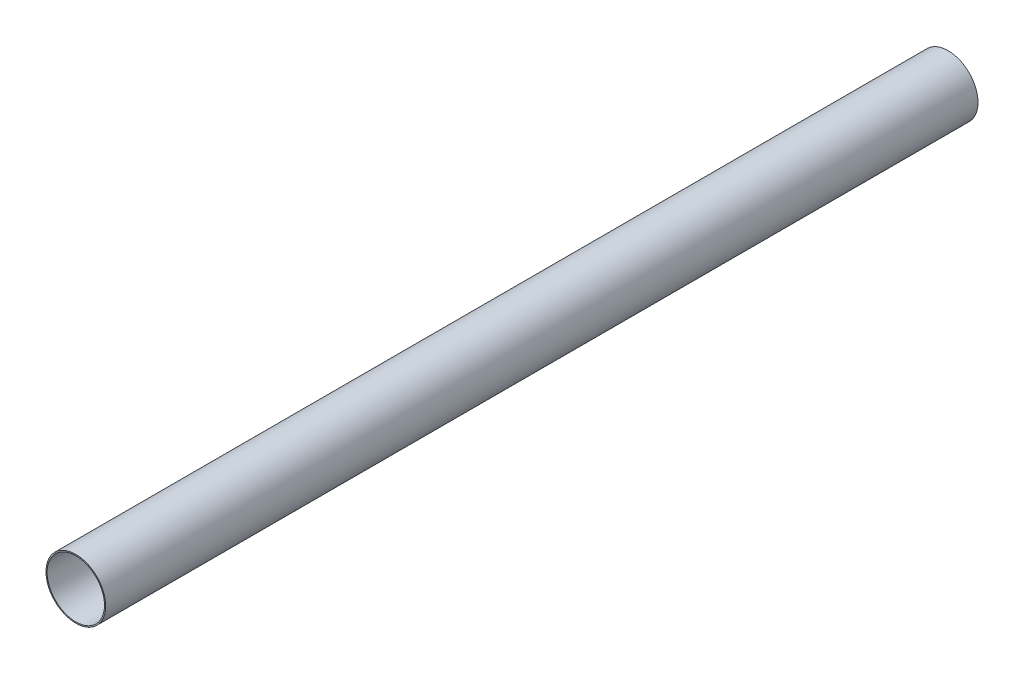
ISO-10303-21;
HEADER;
FILE_DESCRIPTION(('STEP AP214'),'2;1');
FILE_NAME('part.step','',(''),(''),'','','');
FILE_SCHEMA(('AUTOMOTIVE_DESIGN { 1 0 10303 214 1 1 1 1 }'));
ENDSEC;
DATA;
#1=APPLICATION_CONTEXT('core data for automotive mechanical design processes');
#2=APPLICATION_PROTOCOL_DEFINITION('international standard','automotive_design',2000,#1);
#3=PRODUCT_CONTEXT('',#1,'mechanical');
#4=PRODUCT('Part','Part','',(#3));
#5=PRODUCT_RELATED_PRODUCT_CATEGORY('part','',(#4));
#6=PRODUCT_DEFINITION_FORMATION('','',#4);
#7=PRODUCT_DEFINITION_CONTEXT('part definition',#1,'design');
#8=PRODUCT_DEFINITION('design','',#6,#7);
#9=PRODUCT_DEFINITION_SHAPE('','',#8);
#10=(LENGTH_UNIT() NAMED_UNIT(*) SI_UNIT(.MILLI.,.METRE.));
#11=(NAMED_UNIT(*) PLANE_ANGLE_UNIT() SI_UNIT($,.RADIAN.));
#12=(NAMED_UNIT(*) SI_UNIT($,.STERADIAN.) SOLID_ANGLE_UNIT());
#13=UNCERTAINTY_MEASURE_WITH_UNIT(LENGTH_MEASURE(1.E-05),#10,'distance_accuracy_value','');
#14=(GEOMETRIC_REPRESENTATION_CONTEXT(3) GLOBAL_UNCERTAINTY_ASSIGNED_CONTEXT((#13)) GLOBAL_UNIT_ASSIGNED_CONTEXT((#10,
#11,#12)) REPRESENTATION_CONTEXT('',''));
#15=CARTESIAN_POINT('',(0.,0.,0.));
#16=DIRECTION('',(0.,0.,1.));
#17=DIRECTION('',(1.,0.,0.));
#18=AXIS2_PLACEMENT_3D('',#15,#16,#17);
#19=CARTESIAN_POINT('',(0.,0.,380.));
#20=DIRECTION('',(0.,0.,1.));
#21=DIRECTION('',(1.,0.,0.));
#22=AXIS2_PLACEMENT_3D('',#19,#20,#21);
#23=PLANE('',#22);
#24=CARTESIAN_POINT('',(0.,0.,380.));
#25=DIRECTION('',(0.,0.,1.));
#26=DIRECTION('',(1.,0.,0.));
#27=AXIS2_PLACEMENT_3D('',#24,#25,#26);
#28=CIRCLE('',#27,26.);
#29=CARTESIAN_POINT('',(26.,0.,380.));
#30=VERTEX_POINT('',#29);
#31=EDGE_CURVE('E10',#30,#30,#28,.T.);
#32=ORIENTED_EDGE('',*,*,#31,.T.);
#33=EDGE_LOOP('',(#32));
#34=FACE_BOUND('',#33,.T.);
#35=CARTESIAN_POINT('',(0.,0.,380.));
#36=DIRECTION('',(0.,0.,1.));
#37=DIRECTION('',(1.,0.,0.));
#38=AXIS2_PLACEMENT_3D('',#35,#36,#37);
#39=CIRCLE('',#38,25.);
#40=CARTESIAN_POINT('',(25.,0.,380.));
#41=VERTEX_POINT('',#40);
#42=EDGE_CURVE('E45',#41,#41,#39,.T.);
#43=ORIENTED_EDGE('',*,*,#42,.F.);
#44=EDGE_LOOP('',(#43));
#45=FACE_BOUND('',#44,.T.);
#46=ADVANCED_FACE('F37',(#34,#45),#23,.T.);
#47=CARTESIAN_POINT('',(0.,0.,380.));
#48=DIRECTION('',(0.,0.,-1.));
#49=DIRECTION('',(-1.,0.,0.));
#50=AXIS2_PLACEMENT_3D('',#47,#48,#49);
#51=CYLINDRICAL_SURFACE('',#50,26.);
#52=ORIENTED_EDGE('',*,*,#31,.F.);
#53=EDGE_LOOP('',(#52));
#54=FACE_BOUND('',#53,.T.);
#55=CARTESIAN_POINT('',(0.,0.,-380.));
#56=DIRECTION('',(0.,0.,1.));
#57=DIRECTION('',(1.,0.,0.));
#58=AXIS2_PLACEMENT_3D('',#55,#56,#57);
#59=CIRCLE('',#58,26.);
#60=CARTESIAN_POINT('',(26.,0.,-380.));
#61=VERTEX_POINT('',#60);
#62=EDGE_CURVE('E50',#61,#61,#59,.T.);
#63=ORIENTED_EDGE('',*,*,#62,.T.);
#64=EDGE_LOOP('',(#63));
#65=FACE_BOUND('',#64,.T.);
#66=ADVANCED_FACE('F39',(#54,#65),#51,.T.);
#67=CARTESIAN_POINT('',(0.,0.,380.));
#68=DIRECTION('',(0.,0.,-1.));
#69=DIRECTION('',(-1.,0.,0.));
#70=AXIS2_PLACEMENT_3D('',#67,#68,#69);
#71=CYLINDRICAL_SURFACE('',#70,25.);
#72=ORIENTED_EDGE('',*,*,#42,.T.);
#73=EDGE_LOOP('',(#72));
#74=FACE_BOUND('',#73,.T.);
#75=CARTESIAN_POINT('',(0.,0.,-380.));
#76=DIRECTION('',(0.,0.,1.));
#77=DIRECTION('',(1.,0.,0.));
#78=AXIS2_PLACEMENT_3D('',#75,#76,#77);
#79=CIRCLE('',#78,25.);
#80=CARTESIAN_POINT('',(25.,0.,-380.));
#81=VERTEX_POINT('',#80);
#82=EDGE_CURVE('E55',#81,#81,#79,.T.);
#83=ORIENTED_EDGE('',*,*,#82,.F.);
#84=EDGE_LOOP('',(#83));
#85=FACE_BOUND('',#84,.T.);
#86=ADVANCED_FACE('F65',(#74,#85),#71,.F.);
#87=CARTESIAN_POINT('',(0.,0.,-380.));
#88=DIRECTION('',(0.,0.,1.));
#89=DIRECTION('',(1.,0.,0.));
#90=AXIS2_PLACEMENT_3D('',#87,#88,#89);
#91=PLANE('',#90);
#92=ORIENTED_EDGE('',*,*,#82,.T.);
#93=EDGE_LOOP('',(#92));
#94=FACE_BOUND('',#93,.T.);
#95=ORIENTED_EDGE('',*,*,#62,.F.);
#96=EDGE_LOOP('',(#95));
#97=FACE_BOUND('',#96,.T.);
#98=ADVANCED_FACE('F62',(#94,#97),#91,.F.);
#99=CLOSED_SHELL('',(#46,#66,#86,#98));
#100=MANIFOLD_SOLID_BREP('B2',#99);
#101=ADVANCED_BREP_SHAPE_REPRESENTATION('',(#18,#100),#14);
#102=SHAPE_DEFINITION_REPRESENTATION(#9,#101);
ENDSEC;
END-ISO-10303-21;
